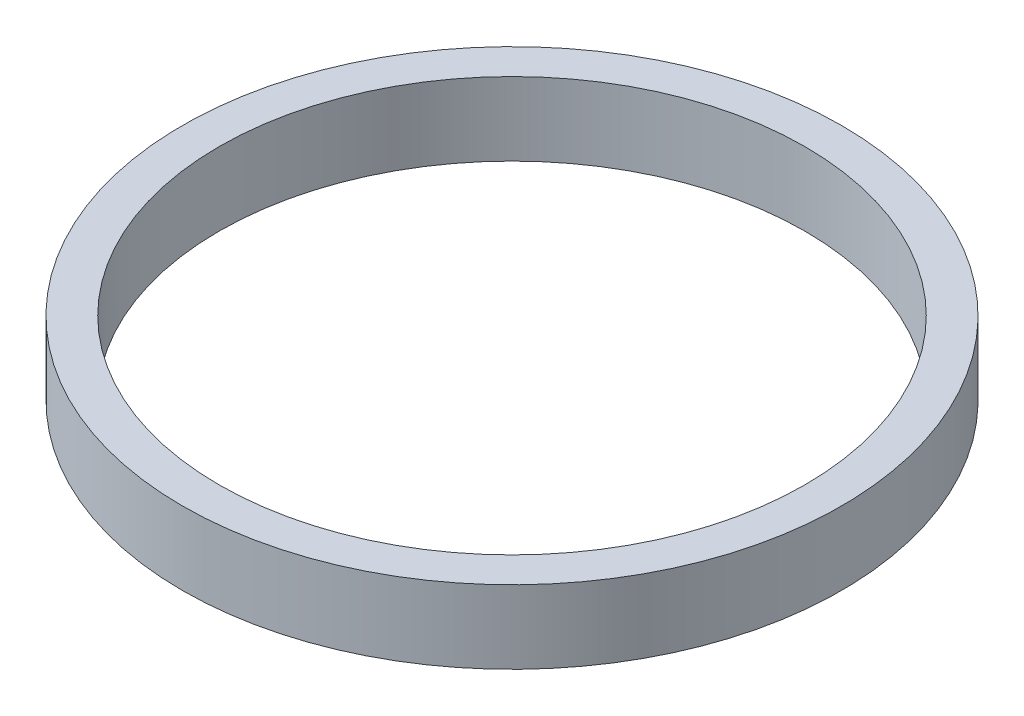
from build123d import *

# Parameters (mm, degrees)
SKETCH1_R           = 45
SKETCH1_R_2         = 40
BOSS_EXTRUDE1_DEPTH = 10


with BuildPart() as part:
    # Sketch1 → Boss-Extrude1 (new body)
    with BuildSketch(Plane(origin=(0, 0, 0), x_dir=(1, 0, 0), z_dir=(0, 1, 0))):
        with Locations(Location((0, 0, 0), (0, 0, 270))):
            Circle(SKETCH1_R)
        with Locations(Location((0, 0, 0), (0, 0, 270))):
            Circle(SKETCH1_R_2, mode=Mode.SUBTRACT)
    extrude(amount=BOSS_EXTRUDE1_DEPTH)


solid = part.part
